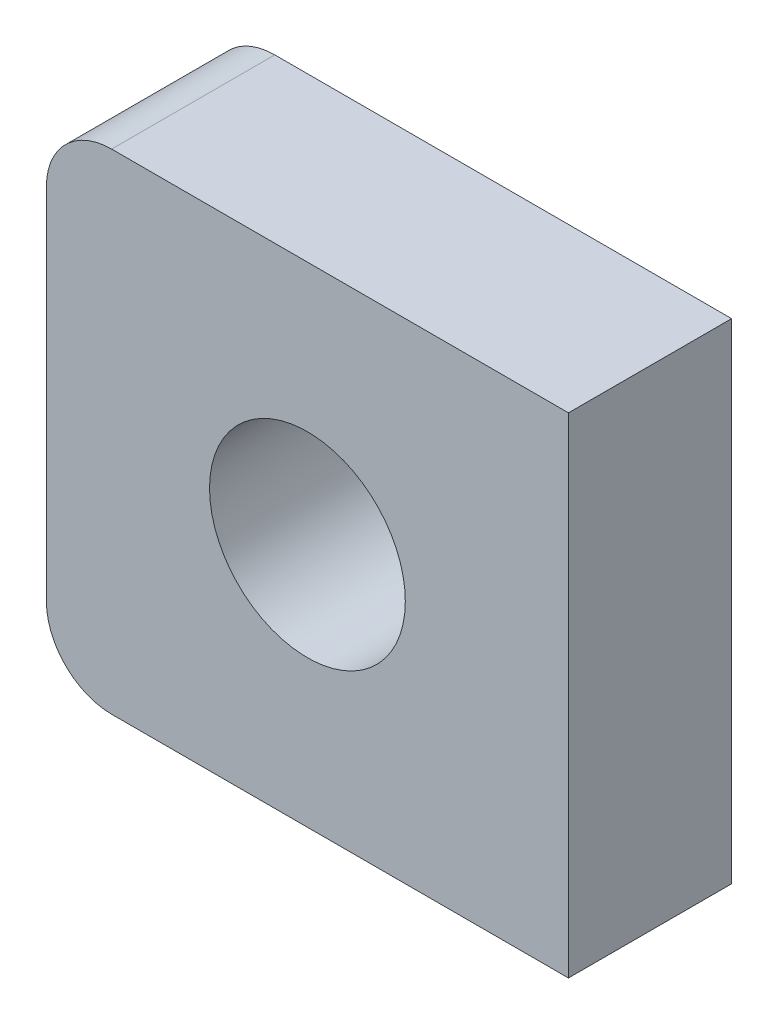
from build123d import *

# Parameters (mm, degrees)
ESQUISSE1_W                  = 26
ESQUISSE1_H                  = 15
ESQUISSE1_R                  = 3
ESQUISSE1_R_2                = 2
BOSS_EXTRU_1_DEPTH           = 5
CONG_1_R                     = 2
ENL_V_MAT_EXTRU_1_DEPTH      = 16.81929202
ENL_V_MAT_EXTRU_1_DEPTH_BACK = 16.81929202
ESQUISSE2_W                  = 10
ESQUISSE2_H                  = 15


with BuildPart() as part:
    # Esquisse1 → Boss.-Extru.1 (new body)
    with BuildSketch(Plane.XY):
        Rectangle(ESQUISSE1_W, ESQUISSE1_H)
        with Locations((-5, 0)):
            Circle(ESQUISSE1_R, mode=Mode.SUBTRACT)
        with Locations((8, -2.5)):
            Circle(ESQUISSE1_R_2, mode=Mode.SUBTRACT)
    extrude(amount=BOSS_EXTRU_1_DEPTH)

    # Cong_1
    cong_1_edges = [part.edges().sort_by_distance(p)[0] for p in [
        (13, -7.5, 2.5),
        (-13, -7.5, 2.5),
        (-13, 7.5, 2.5),
        (13, 7.5, 2.5),
    ]]
    fillet(cong_1_edges, radius=CONG_1_R)

    # Esquisse2 → Enl_v. mat.-Extru.1 (cut, two sides: drawn at the far end of the back side and taken through both)
    with BuildSketch(Plane.XY.offset(5).offset(-ENL_V_MAT_EXTRU_1_DEPTH_BACK)):
        with Locations((8, 0)):
            Rectangle(ESQUISSE2_W, ESQUISSE2_H)
    extrude(amount=ENL_V_MAT_EXTRU_1_DEPTH + ENL_V_MAT_EXTRU_1_DEPTH_BACK, mode=Mode.SUBTRACT)


solid = part.part
